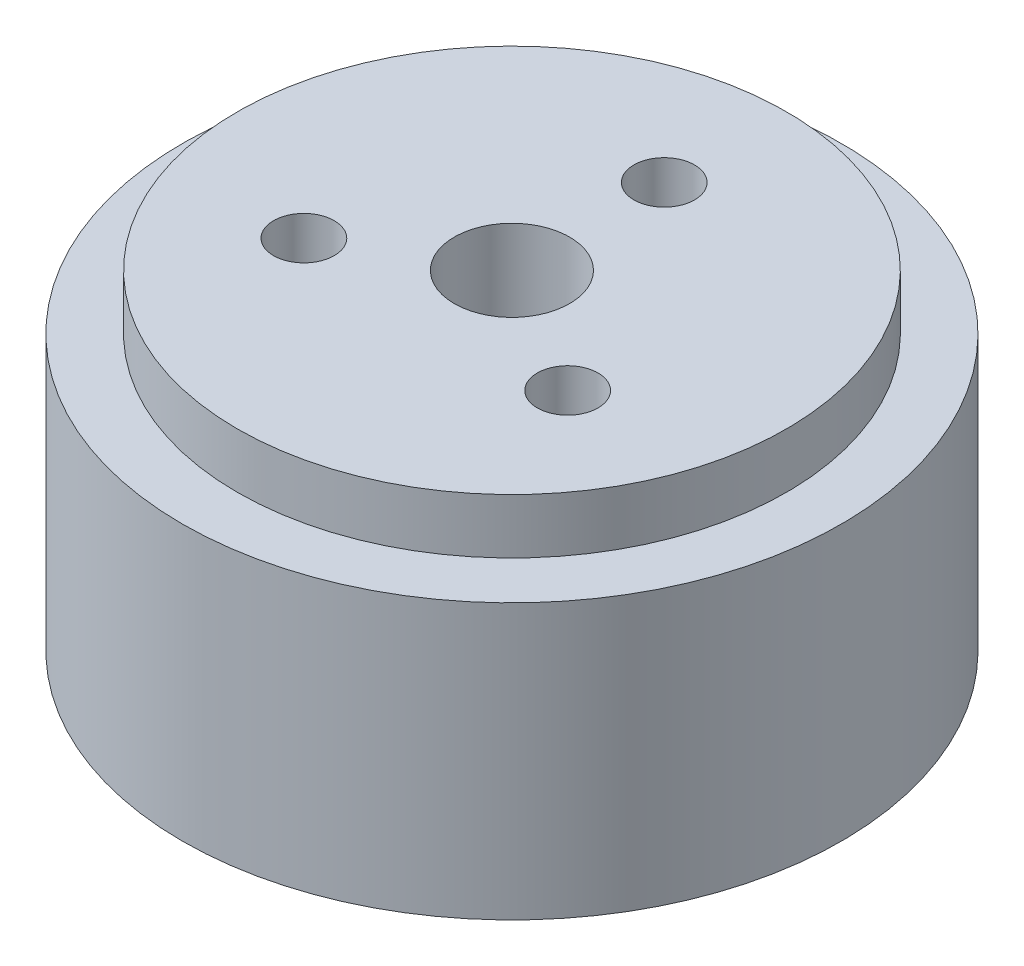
ISO-10303-21;
HEADER;
FILE_DESCRIPTION(('STEP AP214'),'2;1');
FILE_NAME('part.step','',(''),(''),'','','');
FILE_SCHEMA(('AUTOMOTIVE_DESIGN { 1 0 10303 214 1 1 1 1 }'));
ENDSEC;
DATA;
#1=APPLICATION_CONTEXT('core data for automotive mechanical design processes');
#2=APPLICATION_PROTOCOL_DEFINITION('international standard','automotive_design',2000,#1);
#3=PRODUCT_CONTEXT('',#1,'mechanical');
#4=PRODUCT('Part','Part','',(#3));
#5=PRODUCT_RELATED_PRODUCT_CATEGORY('part','',(#4));
#6=PRODUCT_DEFINITION_FORMATION('','',#4);
#7=PRODUCT_DEFINITION_CONTEXT('part definition',#1,'design');
#8=PRODUCT_DEFINITION('design','',#6,#7);
#9=PRODUCT_DEFINITION_SHAPE('','',#8);
#10=(LENGTH_UNIT() NAMED_UNIT(*) SI_UNIT(.MILLI.,.METRE.));
#11=(NAMED_UNIT(*) PLANE_ANGLE_UNIT() SI_UNIT($,.RADIAN.));
#12=(NAMED_UNIT(*) SI_UNIT($,.STERADIAN.) SOLID_ANGLE_UNIT());
#13=UNCERTAINTY_MEASURE_WITH_UNIT(LENGTH_MEASURE(1.E-05),#10,'distance_accuracy_value','');
#14=(GEOMETRIC_REPRESENTATION_CONTEXT(3) GLOBAL_UNCERTAINTY_ASSIGNED_CONTEXT((#13)) GLOBAL_UNIT_ASSIGNED_CONTEXT((#10,
#11,#12)) REPRESENTATION_CONTEXT('',''));
#15=CARTESIAN_POINT('',(0.,0.,0.));
#16=DIRECTION('',(0.,0.,1.));
#17=DIRECTION('',(1.,0.,0.));
#18=AXIS2_PLACEMENT_3D('',#15,#16,#17);
#19=CARTESIAN_POINT('',(0.,10.,0.));
#20=DIRECTION('',(0.,-1.,0.));
#21=DIRECTION('',(0.,0.,-1.));
#22=AXIS2_PLACEMENT_3D('',#19,#20,#21);
#23=CYLINDRICAL_SURFACE('',#22,12.);
#24=CARTESIAN_POINT('',(0.,10.,0.));
#25=DIRECTION('',(0.,1.,0.));
#26=DIRECTION('',(0.,0.,1.));
#27=AXIS2_PLACEMENT_3D('',#24,#25,#26);
#28=CIRCLE('',#27,12.);
#29=CARTESIAN_POINT('',(0.,10.,12.));
#30=VERTEX_POINT('',#29);
#31=EDGE_CURVE('E39',#30,#30,#28,.T.);
#32=ORIENTED_EDGE('',*,*,#31,.F.);
#33=EDGE_LOOP('',(#32));
#34=FACE_BOUND('',#33,.T.);
#35=CARTESIAN_POINT('',(0.,0.,0.));
#36=DIRECTION('',(0.,1.,0.));
#37=DIRECTION('',(0.,0.,1.));
#38=AXIS2_PLACEMENT_3D('',#35,#36,#37);
#39=CIRCLE('',#38,12.);
#40=CARTESIAN_POINT('',(0.,0.,12.));
#41=VERTEX_POINT('',#40);
#42=EDGE_CURVE('E35',#41,#41,#39,.T.);
#43=ORIENTED_EDGE('',*,*,#42,.T.);
#44=EDGE_LOOP('',(#43));
#45=FACE_BOUND('',#44,.T.);
#46=ADVANCED_FACE('F32',(#34,#45),#23,.T.);
#47=CARTESIAN_POINT('',(0.,10.,0.));
#48=DIRECTION('',(0.,1.,0.));
#49=DIRECTION('',(0.,0.,1.));
#50=AXIS2_PLACEMENT_3D('',#47,#48,#49);
#51=PLANE('',#50);
#52=CARTESIAN_POINT('',(0.,10.,0.));
#53=DIRECTION('',(0.,1.,0.));
#54=DIRECTION('',(0.,0.,1.));
#55=AXIS2_PLACEMENT_3D('',#52,#53,#54);
#56=CIRCLE('',#55,10.);
#57=CARTESIAN_POINT('',(0.,10.,10.));
#58=VERTEX_POINT('',#57);
#59=EDGE_CURVE('E10',#58,#58,#56,.T.);
#60=ORIENTED_EDGE('',*,*,#59,.F.);
#61=EDGE_LOOP('',(#60));
#62=FACE_BOUND('',#61,.T.);
#63=ORIENTED_EDGE('',*,*,#31,.T.);
#64=EDGE_LOOP('',(#63));
#65=FACE_BOUND('',#64,.T.);
#66=ADVANCED_FACE('F96',(#62,#65),#51,.T.);
#67=CARTESIAN_POINT('',(0.,0.,0.));
#68=DIRECTION('',(0.,1.,0.));
#69=DIRECTION('',(0.,0.,1.));
#70=AXIS2_PLACEMENT_3D('',#67,#68,#69);
#71=PLANE('',#70);
#72=CARTESIAN_POINT('',(0.,0.,0.));
#73=DIRECTION('',(0.,1.,0.));
#74=DIRECTION('',(0.,0.,1.));
#75=AXIS2_PLACEMENT_3D('',#72,#73,#74);
#76=CIRCLE('',#75,2.1);
#77=CARTESIAN_POINT('',(0.,0.,2.1));
#78=VERTEX_POINT('',#77);
#79=EDGE_CURVE('E53',#78,#78,#76,.T.);
#80=ORIENTED_EDGE('',*,*,#79,.T.);
#81=EDGE_LOOP('',(#80));
#82=FACE_BOUND('',#81,.T.);
#83=ORIENTED_EDGE('',*,*,#42,.F.);
#84=EDGE_LOOP('',(#83));
#85=FACE_BOUND('',#84,.T.);
#86=ADVANCED_FACE('F91',(#82,#85),#71,.F.);
#87=CARTESIAN_POINT('',(0.,12.,0.));
#88=DIRECTION('',(0.,-1.,0.));
#89=DIRECTION('',(0.,0.,-1.));
#90=AXIS2_PLACEMENT_3D('',#87,#88,#89);
#91=CYLINDRICAL_SURFACE('',#90,10.);
#92=CARTESIAN_POINT('',(0.,12.,0.));
#93=DIRECTION('',(0.,1.,0.));
#94=DIRECTION('',(0.,0.,1.));
#95=AXIS2_PLACEMENT_3D('',#92,#93,#94);
#96=CIRCLE('',#95,10.);
#97=CARTESIAN_POINT('',(0.,12.,10.));
#98=VERTEX_POINT('',#97);
#99=EDGE_CURVE('E45',#98,#98,#96,.T.);
#100=ORIENTED_EDGE('',*,*,#99,.F.);
#101=EDGE_LOOP('',(#100));
#102=FACE_BOUND('',#101,.T.);
#103=ORIENTED_EDGE('',*,*,#59,.T.);
#104=EDGE_LOOP('',(#103));
#105=FACE_BOUND('',#104,.T.);
#106=ADVANCED_FACE('F80',(#102,#105),#91,.T.);
#107=CARTESIAN_POINT('',(0.,12.,0.));
#108=DIRECTION('',(0.,1.,0.));
#109=DIRECTION('',(0.,0.,1.));
#110=AXIS2_PLACEMENT_3D('',#107,#108,#109);
#111=PLANE('',#110);
#112=CARTESIAN_POINT('',(0.,12.,0.));
#113=DIRECTION('',(0.,1.,0.));
#114=DIRECTION('',(0.,0.,1.));
#115=AXIS2_PLACEMENT_3D('',#112,#113,#114);
#116=CIRCLE('',#115,2.1);
#117=CARTESIAN_POINT('',(0.,12.,2.1));
#118=VERTEX_POINT('',#117);
#119=EDGE_CURVE('E69',#118,#118,#116,.T.);
#120=ORIENTED_EDGE('',*,*,#119,.F.);
#121=EDGE_LOOP('',(#120));
#122=FACE_BOUND('',#121,.T.);
#123=CARTESIAN_POINT('',(0.,12.,-5.54525543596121));
#124=DIRECTION('',(0.,1.,0.));
#125=DIRECTION('',(0.,0.,1.));
#126=AXIS2_PLACEMENT_3D('',#123,#124,#125);
#127=CIRCLE('',#126,1.1046572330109);
#128=CARTESIAN_POINT('',(0.,12.,-4.44059820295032));
#129=VERTEX_POINT('',#128);
#130=EDGE_CURVE('E62',#129,#129,#127,.T.);
#131=ORIENTED_EDGE('',*,*,#130,.F.);
#132=EDGE_LOOP('',(#131));
#133=FACE_BOUND('',#132,.T.);
#134=CARTESIAN_POINT('',(4.80233207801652,12.,2.7726277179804));
#135=DIRECTION('',(0.,1.,0.));
#136=DIRECTION('',(0.,0.,1.));
#137=AXIS2_PLACEMENT_3D('',#134,#135,#136);
#138=CIRCLE('',#137,1.1046572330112);
#139=CARTESIAN_POINT('',(4.80233207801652,12.,3.8772849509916));
#140=VERTEX_POINT('',#139);
#141=EDGE_CURVE('E56',#140,#140,#138,.T.);
#142=ORIENTED_EDGE('',*,*,#141,.F.);
#143=EDGE_LOOP('',(#142));
#144=FACE_BOUND('',#143,.T.);
#145=CARTESIAN_POINT('',(-4.80233207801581,12.,2.77262771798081));
#146=DIRECTION('',(0.,1.,0.));
#147=DIRECTION('',(0.,0.,1.));
#148=AXIS2_PLACEMENT_3D('',#145,#146,#147);
#149=CIRCLE('',#148,1.10465723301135);
#150=CARTESIAN_POINT('',(-4.80233207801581,12.,3.87728495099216));
#151=VERTEX_POINT('',#150);
#152=EDGE_CURVE('E49',#151,#151,#149,.T.);
#153=ORIENTED_EDGE('',*,*,#152,.F.);
#154=EDGE_LOOP('',(#153));
#155=FACE_BOUND('',#154,.T.);
#156=ORIENTED_EDGE('',*,*,#99,.T.);
#157=EDGE_LOOP('',(#156));
#158=FACE_BOUND('',#157,.T.);
#159=ADVANCED_FACE('F76',(#122,#133,#144,#155,#158),#111,.T.);
#160=CARTESIAN_POINT('',(-4.80233207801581,8.,2.77262771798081));
#161=DIRECTION('',(0.,1.,0.));
#162=DIRECTION('',(0.,0.,1.));
#163=AXIS2_PLACEMENT_3D('',#160,#161,#162);
#164=CYLINDRICAL_SURFACE('',#163,1.10465723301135);
#165=CARTESIAN_POINT('',(-4.80233207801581,8.,2.77262771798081));
#166=DIRECTION('',(0.,1.,0.));
#167=DIRECTION('',(0.,0.,1.));
#168=AXIS2_PLACEMENT_3D('',#165,#166,#167);
#169=CIRCLE('',#168,1.10465723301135);
#170=CARTESIAN_POINT('',(-4.80233207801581,8.,3.87728495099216));
#171=VERTEX_POINT('',#170);
#172=EDGE_CURVE('E52',#171,#171,#169,.T.);
#173=ORIENTED_EDGE('',*,*,#172,.F.);
#174=EDGE_LOOP('',(#173));
#175=FACE_BOUND('',#174,.T.);
#176=ORIENTED_EDGE('',*,*,#152,.T.);
#177=EDGE_LOOP('',(#176));
#178=FACE_BOUND('',#177,.T.);
#179=ADVANCED_FACE('F79',(#175,#178),#164,.F.);
#180=CARTESIAN_POINT('',(-4.80233207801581,8.,2.77262771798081));
#181=DIRECTION('',(0.,1.,0.));
#182=DIRECTION('',(0.,0.,1.));
#183=AXIS2_PLACEMENT_3D('',#180,#181,#182);
#184=PLANE('',#183);
#185=ORIENTED_EDGE('',*,*,#172,.T.);
#186=EDGE_LOOP('',(#185));
#187=FACE_BOUND('',#186,.T.);
#188=ADVANCED_FACE('F167',(#187),#184,.T.);
#189=CARTESIAN_POINT('',(4.80233207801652,8.,2.7726277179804));
#190=DIRECTION('',(0.,1.,0.));
#191=DIRECTION('',(0.,0.,1.));
#192=AXIS2_PLACEMENT_3D('',#189,#190,#191);
#193=CYLINDRICAL_SURFACE('',#192,1.1046572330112);
#194=CARTESIAN_POINT('',(4.80233207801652,8.,2.7726277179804));
#195=DIRECTION('',(0.,1.,0.));
#196=DIRECTION('',(0.,0.,1.));
#197=AXIS2_PLACEMENT_3D('',#194,#195,#196);
#198=CIRCLE('',#197,1.1046572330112);
#199=CARTESIAN_POINT('',(4.80233207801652,8.,3.8772849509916));
#200=VERTEX_POINT('',#199);
#201=EDGE_CURVE('E59',#200,#200,#198,.T.);
#202=ORIENTED_EDGE('',*,*,#201,.F.);
#203=EDGE_LOOP('',(#202));
#204=FACE_BOUND('',#203,.T.);
#205=ORIENTED_EDGE('',*,*,#141,.T.);
#206=EDGE_LOOP('',(#205));
#207=FACE_BOUND('',#206,.T.);
#208=ADVANCED_FACE('F159',(#204,#207),#193,.F.);
#209=CARTESIAN_POINT('',(4.80233207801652,8.,2.7726277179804));
#210=DIRECTION('',(0.,1.,0.));
#211=DIRECTION('',(0.,0.,1.));
#212=AXIS2_PLACEMENT_3D('',#209,#210,#211);
#213=PLANE('',#212);
#214=ORIENTED_EDGE('',*,*,#201,.T.);
#215=EDGE_LOOP('',(#214));
#216=FACE_BOUND('',#215,.T.);
#217=ADVANCED_FACE('F151',(#216),#213,.T.);
#218=CARTESIAN_POINT('',(0.,8.,-5.54525543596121));
#219=DIRECTION('',(0.,1.,0.));
#220=DIRECTION('',(0.,0.,1.));
#221=AXIS2_PLACEMENT_3D('',#218,#219,#220);
#222=CYLINDRICAL_SURFACE('',#221,1.1046572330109);
#223=CARTESIAN_POINT('',(0.,8.,-5.54525543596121));
#224=DIRECTION('',(0.,1.,0.));
#225=DIRECTION('',(0.,0.,1.));
#226=AXIS2_PLACEMENT_3D('',#223,#224,#225);
#227=CIRCLE('',#226,1.1046572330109);
#228=CARTESIAN_POINT('',(0.,8.,-4.44059820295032));
#229=VERTEX_POINT('',#228);
#230=EDGE_CURVE('E48',#229,#229,#227,.T.);
#231=ORIENTED_EDGE('',*,*,#230,.F.);
#232=EDGE_LOOP('',(#231));
#233=FACE_BOUND('',#232,.T.);
#234=ORIENTED_EDGE('',*,*,#130,.T.);
#235=EDGE_LOOP('',(#234));
#236=FACE_BOUND('',#235,.T.);
#237=ADVANCED_FACE('F146',(#233,#236),#222,.F.);
#238=CARTESIAN_POINT('',(0.,8.,-5.54525543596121));
#239=DIRECTION('',(0.,1.,0.));
#240=DIRECTION('',(0.,0.,1.));
#241=AXIS2_PLACEMENT_3D('',#238,#239,#240);
#242=PLANE('',#241);
#243=ORIENTED_EDGE('',*,*,#230,.T.);
#244=EDGE_LOOP('',(#243));
#245=FACE_BOUND('',#244,.T.);
#246=ADVANCED_FACE('F124',(#245),#242,.T.);
#247=CARTESIAN_POINT('',(0.,-8.,0.));
#248=DIRECTION('',(0.,1.,0.));
#249=DIRECTION('',(0.,0.,1.));
#250=AXIS2_PLACEMENT_3D('',#247,#248,#249);
#251=CYLINDRICAL_SURFACE('',#250,2.1);
#252=ORIENTED_EDGE('',*,*,#119,.T.);
#253=EDGE_LOOP('',(#252));
#254=FACE_BOUND('',#253,.T.);
#255=ORIENTED_EDGE('',*,*,#79,.F.);
#256=EDGE_LOOP('',(#255));
#257=FACE_BOUND('',#256,.T.);
#258=ADVANCED_FACE('F73',(#254,#257),#251,.F.);
#259=CLOSED_SHELL('',(#46,#66,#86,#106,#159,#179,#188,#208,#217,#237,#246,#258));
#260=MANIFOLD_SOLID_BREP('B2',#259);
#261=ADVANCED_BREP_SHAPE_REPRESENTATION('',(#18,#260),#14);
#262=SHAPE_DEFINITION_REPRESENTATION(#9,#261);
ENDSEC;
END-ISO-10303-21;
